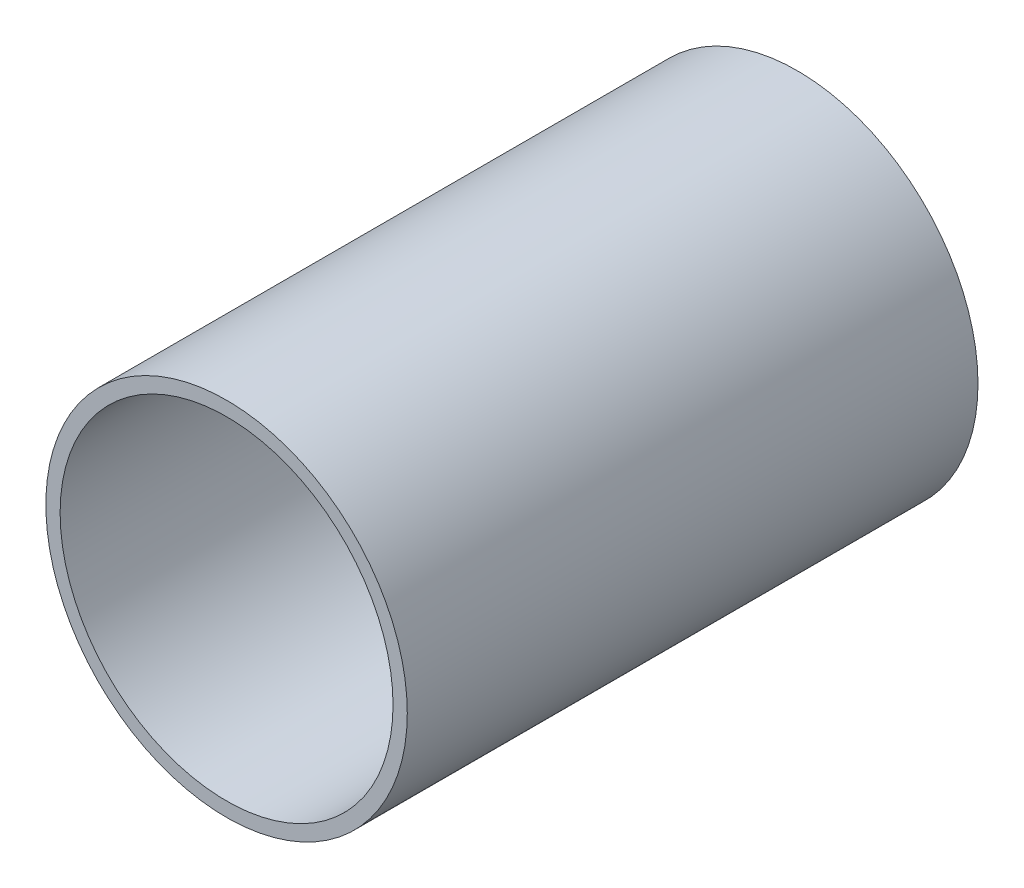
ISO-10303-21;
HEADER;
FILE_DESCRIPTION(('STEP AP214'),'2;1');
FILE_NAME('part.step','',(''),(''),'','','');
FILE_SCHEMA(('AUTOMOTIVE_DESIGN { 1 0 10303 214 1 1 1 1 }'));
ENDSEC;
DATA;
#1=APPLICATION_CONTEXT('core data for automotive mechanical design processes');
#2=APPLICATION_PROTOCOL_DEFINITION('international standard','automotive_design',2000,#1);
#3=PRODUCT_CONTEXT('',#1,'mechanical');
#4=PRODUCT('Part','Part','',(#3));
#5=PRODUCT_RELATED_PRODUCT_CATEGORY('part','',(#4));
#6=PRODUCT_DEFINITION_FORMATION('','',#4);
#7=PRODUCT_DEFINITION_CONTEXT('part definition',#1,'design');
#8=PRODUCT_DEFINITION('design','',#6,#7);
#9=PRODUCT_DEFINITION_SHAPE('','',#8);
#10=(LENGTH_UNIT() NAMED_UNIT(*) SI_UNIT(.MILLI.,.METRE.));
#11=(NAMED_UNIT(*) PLANE_ANGLE_UNIT() SI_UNIT($,.RADIAN.));
#12=(NAMED_UNIT(*) SI_UNIT($,.STERADIAN.) SOLID_ANGLE_UNIT());
#13=UNCERTAINTY_MEASURE_WITH_UNIT(LENGTH_MEASURE(1.E-05),#10,'distance_accuracy_value','');
#14=(GEOMETRIC_REPRESENTATION_CONTEXT(3) GLOBAL_UNCERTAINTY_ASSIGNED_CONTEXT((#13)) GLOBAL_UNIT_ASSIGNED_CONTEXT((#10,
#11,#12)) REPRESENTATION_CONTEXT('',''));
#15=CARTESIAN_POINT('',(0.,0.,0.));
#16=DIRECTION('',(0.,0.,1.));
#17=DIRECTION('',(1.,0.,0.));
#18=AXIS2_PLACEMENT_3D('',#15,#16,#17);
#19=CARTESIAN_POINT('',(0.,0.,60.));
#20=DIRECTION('',(0.,0.,1.));
#21=DIRECTION('',(1.,0.,0.));
#22=AXIS2_PLACEMENT_3D('',#19,#20,#21);
#23=PLANE('',#22);
#24=CARTESIAN_POINT('',(0.,0.,60.));
#25=DIRECTION('',(0.,0.,1.));
#26=DIRECTION('',(1.,0.,0.));
#27=AXIS2_PLACEMENT_3D('',#24,#25,#26);
#28=CIRCLE('',#27,19.);
#29=CARTESIAN_POINT('',(19.,0.,60.));
#30=VERTEX_POINT('',#29);
#31=EDGE_CURVE('E10',#30,#30,#28,.T.);
#32=ORIENTED_EDGE('',*,*,#31,.T.);
#33=EDGE_LOOP('',(#32));
#34=FACE_BOUND('',#33,.T.);
#35=CARTESIAN_POINT('',(0.,0.,60.));
#36=DIRECTION('',(0.,0.,1.));
#37=DIRECTION('',(1.,0.,0.));
#38=AXIS2_PLACEMENT_3D('',#35,#36,#37);
#39=CIRCLE('',#38,17.5);
#40=CARTESIAN_POINT('',(17.5,0.,60.));
#41=VERTEX_POINT('',#40);
#42=EDGE_CURVE('E38',#41,#41,#39,.T.);
#43=ORIENTED_EDGE('',*,*,#42,.F.);
#44=EDGE_LOOP('',(#43));
#45=FACE_BOUND('',#44,.T.);
#46=ADVANCED_FACE('F27',(#34,#45),#23,.T.);
#47=CARTESIAN_POINT('',(0.,0.,0.));
#48=DIRECTION('',(0.,0.,1.));
#49=DIRECTION('',(1.,0.,0.));
#50=AXIS2_PLACEMENT_3D('',#47,#48,#49);
#51=PLANE('',#50);
#52=CARTESIAN_POINT('',(0.,0.,0.));
#53=DIRECTION('',(0.,0.,1.));
#54=DIRECTION('',(1.,0.,0.));
#55=AXIS2_PLACEMENT_3D('',#52,#53,#54);
#56=CIRCLE('',#55,19.);
#57=CARTESIAN_POINT('',(19.,0.,0.));
#58=VERTEX_POINT('',#57);
#59=EDGE_CURVE('E34',#58,#58,#56,.T.);
#60=ORIENTED_EDGE('',*,*,#59,.F.);
#61=EDGE_LOOP('',(#60));
#62=FACE_BOUND('',#61,.T.);
#63=CARTESIAN_POINT('',(0.,0.,0.));
#64=DIRECTION('',(0.,0.,1.));
#65=DIRECTION('',(1.,0.,0.));
#66=AXIS2_PLACEMENT_3D('',#63,#64,#65);
#67=CIRCLE('',#66,17.5);
#68=CARTESIAN_POINT('',(17.5,0.,0.));
#69=VERTEX_POINT('',#68);
#70=EDGE_CURVE('E42',#69,#69,#67,.T.);
#71=ORIENTED_EDGE('',*,*,#70,.T.);
#72=EDGE_LOOP('',(#71));
#73=FACE_BOUND('',#72,.T.);
#74=ADVANCED_FACE('F48',(#62,#73),#51,.F.);
#75=CARTESIAN_POINT('',(0.,0.,60.));
#76=DIRECTION('',(0.,0.,-1.));
#77=DIRECTION('',(-1.,0.,0.));
#78=AXIS2_PLACEMENT_3D('',#75,#76,#77);
#79=CYLINDRICAL_SURFACE('',#78,19.);
#80=ORIENTED_EDGE('',*,*,#31,.F.);
#81=EDGE_LOOP('',(#80));
#82=FACE_BOUND('',#81,.T.);
#83=ORIENTED_EDGE('',*,*,#59,.T.);
#84=EDGE_LOOP('',(#83));
#85=FACE_BOUND('',#84,.T.);
#86=ADVANCED_FACE('F29',(#82,#85),#79,.T.);
#87=CARTESIAN_POINT('',(0.,0.,60.));
#88=DIRECTION('',(0.,0.,-1.));
#89=DIRECTION('',(-1.,0.,0.));
#90=AXIS2_PLACEMENT_3D('',#87,#88,#89);
#91=CYLINDRICAL_SURFACE('',#90,17.5);
#92=ORIENTED_EDGE('',*,*,#42,.T.);
#93=EDGE_LOOP('',(#92));
#94=FACE_BOUND('',#93,.T.);
#95=ORIENTED_EDGE('',*,*,#70,.F.);
#96=EDGE_LOOP('',(#95));
#97=FACE_BOUND('',#96,.T.);
#98=ADVANCED_FACE('F50',(#94,#97),#91,.F.);
#99=CLOSED_SHELL('',(#46,#74,#86,#98));
#100=MANIFOLD_SOLID_BREP('B2',#99);
#101=ADVANCED_BREP_SHAPE_REPRESENTATION('',(#18,#100),#14);
#102=SHAPE_DEFINITION_REPRESENTATION(#9,#101);
ENDSEC;
END-ISO-10303-21;
